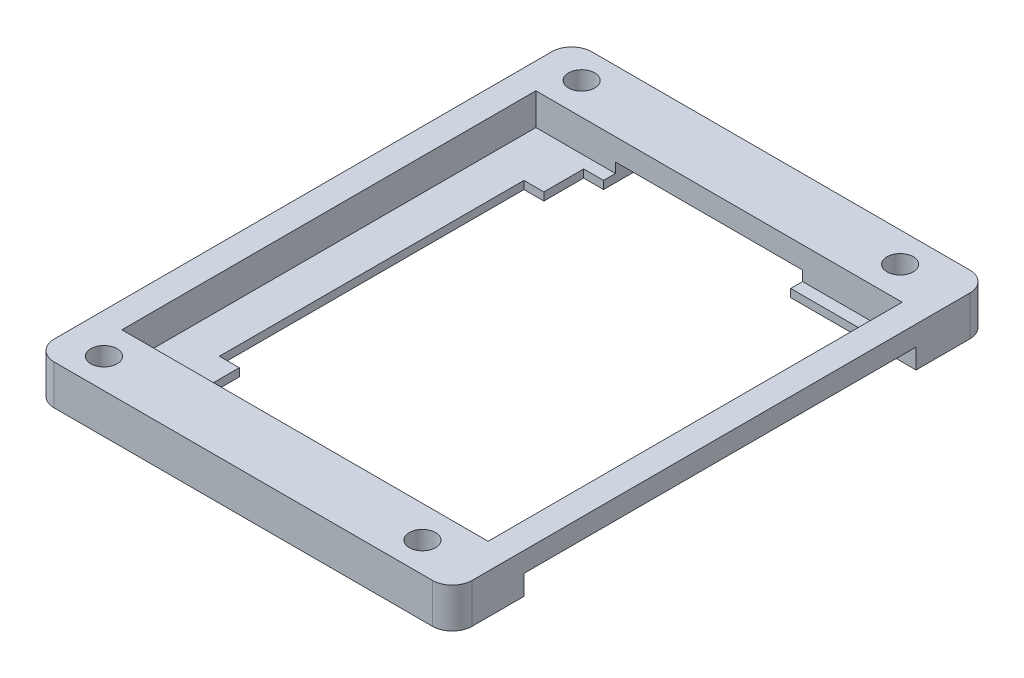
from build123d import *

# Parameters (mm, degrees)
SKETCH1_W               = 105
SKETCH1_H               = 135
SKETCH1_R               = 3.3
SKETCH1_W_2             = 92
SKETCH1_H_2             = 104
BOSS_EXTRUDE1_DEPTH     = 10
SKETCH3_W               = 25
SKETCH3_H               = 3
BOSS_EXTRUDE2_DEPTH     = 2
CUT_EXTRUDE1_DEPTH      = 4.5
CUT_EXTRUDE1_DEPTH_BACK = 87.095876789
CUT_EXTRUDE1_START      = -9.5
SKETCH4_W               = 6.5
SKETCH4_H               = 98.515694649
CUT_EXTRUDE2_DEPTH      = 87.095876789
CUT_EXTRUDE2_DEPTH_BACK = 4.5
SKETCH5_W               = 47
SKETCH5_H               = 15.5
FILLET1_R               = 5


with BuildPart() as part:
    # Sketch1 → Boss-Extrude1 (new body)
    with BuildSketch(Plane(origin=(0, 0, 0), x_dir=(1, 0, 0), z_dir=(0, 1, 0))):
        Rectangle(SKETCH1_W, SKETCH1_H)
        with Locations(Location((-42.5, 60, 0), (0, 0, 270))):
            Circle(SKETCH1_R, mode=Mode.SUBTRACT)
        with Locations(Location((37.5, 60, 0), (0, 0, 270))):
            Circle(SKETCH1_R, mode=Mode.SUBTRACT)
        with Locations(Location((-42.5, -60, 0), (0, 0, 270))):
            Circle(SKETCH1_R, mode=Mode.SUBTRACT)
        with Locations(Location((37.5, -60, 0), (0, 0, 270))):
            Circle(SKETCH1_R, mode=Mode.SUBTRACT)
        Rectangle(SKETCH1_W_2, SKETCH1_H_2, mode=Mode.SUBTRACT)
    extrude(amount=BOSS_EXTRUDE1_DEPTH)

    # Sketch3 → Boss-Extrude2 (add)
    with BuildSketch(Plane(origin=(0, 0, 0), x_dir=(1, 0, 0), z_dir=(0, 1, 0))):
        Polygon((-26, 52), (-46, 52), (-46, -52), (46, -52), (46, -49.5), (41, -49.5), (-31, -49.5), (-31, -37.5), (-36, -37.5), (-36, 39), (-31, 39), (-31, 49), (-26, 49), align=None)
        with Locations((33.5, 50.5)):
            Rectangle(SKETCH3_W, SKETCH3_H)
    extrude(amount=BOSS_EXTRUDE2_DEPTH)

    # Sketch4 → Cut-Extrude1 (cut, two sides: drawn at the far end of the back side and taken through both)
    with BuildSketch(Plane(origin=(0, 10, 0), x_dir=(1, 0, 0), z_dir=(0, 1, 0)).offset(CUT_EXTRUDE1_START - CUT_EXTRUDE1_DEPTH_BACK)):
        with Locations((49.25, -0.257847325)):
            Rectangle(SKETCH4_W, SKETCH4_H)
    extrude(amount=CUT_EXTRUDE1_DEPTH + CUT_EXTRUDE1_DEPTH_BACK, mode=Mode.SUBTRACT)

    # Sketch5 → Cut-Extrude2 (cut, two sides: drawn at the far end of the back side and taken through both)
    with BuildSketch(Plane(origin=(0, 0, 0), x_dir=(-1, 0, 0), z_dir=(0, -1, 0)).offset(-CUT_EXTRUDE2_DEPTH_BACK)):
        with Locations((2.5, 59.75)):
            Rectangle(SKETCH5_W, SKETCH5_H)
    extrude(amount=CUT_EXTRUDE2_DEPTH + CUT_EXTRUDE2_DEPTH_BACK, mode=Mode.SUBTRACT)

    # Fillet1
    fillet1_edges = [part.edges().sort_by_distance(p)[0] for p in [
        (52.5, 5, 67.5),
        (-52.5, 5, 67.5),
        (-52.5, 5, -67.5),
        (52.5, 5, -67.5),
    ]]
    fillet(fillet1_edges, radius=FILLET1_R)


solid = part.part
